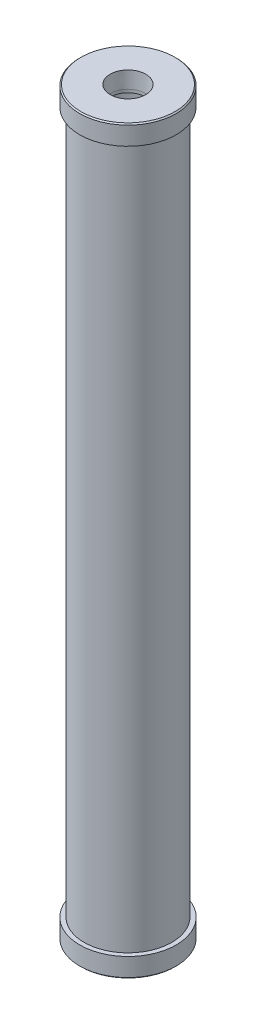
ISO-10303-21;
HEADER;
FILE_DESCRIPTION(('STEP AP214'),'2;1');
FILE_NAME('part.step','',(''),(''),'','','');
FILE_SCHEMA(('AUTOMOTIVE_DESIGN { 1 0 10303 214 1 1 1 1 }'));
ENDSEC;
DATA;
#1=APPLICATION_CONTEXT('core data for automotive mechanical design processes');
#2=APPLICATION_PROTOCOL_DEFINITION('international standard','automotive_design',2000,#1);
#3=PRODUCT_CONTEXT('',#1,'mechanical');
#4=PRODUCT('Part','Part','',(#3));
#5=PRODUCT_RELATED_PRODUCT_CATEGORY('part','',(#4));
#6=PRODUCT_DEFINITION_FORMATION('','',#4);
#7=PRODUCT_DEFINITION_CONTEXT('part definition',#1,'design');
#8=PRODUCT_DEFINITION('design','',#6,#7);
#9=PRODUCT_DEFINITION_SHAPE('','',#8);
#10=(LENGTH_UNIT() NAMED_UNIT(*) SI_UNIT(.MILLI.,.METRE.));
#11=(NAMED_UNIT(*) PLANE_ANGLE_UNIT() SI_UNIT($,.RADIAN.));
#12=(NAMED_UNIT(*) SI_UNIT($,.STERADIAN.) SOLID_ANGLE_UNIT());
#13=UNCERTAINTY_MEASURE_WITH_UNIT(LENGTH_MEASURE(1.E-05),#10,'distance_accuracy_value','');
#14=(GEOMETRIC_REPRESENTATION_CONTEXT(3) GLOBAL_UNCERTAINTY_ASSIGNED_CONTEXT((#13)) GLOBAL_UNIT_ASSIGNED_CONTEXT((#10,
#11,#12)) REPRESENTATION_CONTEXT('',''));
#15=CARTESIAN_POINT('',(0.,0.,0.));
#16=DIRECTION('',(0.,0.,1.));
#17=DIRECTION('',(1.,0.,0.));
#18=AXIS2_PLACEMENT_3D('',#15,#16,#17);
#19=CARTESIAN_POINT('',(0.,965.2,0.));
#20=DIRECTION('',(0.,-1.,0.));
#21=DIRECTION('',(0.,0.,-1.));
#22=AXIS2_PLACEMENT_3D('',#19,#20,#21);
#23=CYLINDRICAL_SURFACE('',#22,57.15);
#24=CARTESIAN_POINT('',(0.,25.4,0.));
#25=DIRECTION('',(0.,1.,0.));
#26=DIRECTION('',(0.,0.,1.));
#27=AXIS2_PLACEMENT_3D('',#24,#25,#26);
#28=CIRCLE('',#27,57.15);
#29=CARTESIAN_POINT('',(0.,25.3999999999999,-57.15));
#30=VERTEX_POINT('',#29);
#31=EDGE_CURVE('E71',#30,#30,#28,.T.);
#32=CARTESIAN_POINT('',(0.,939.8,0.));
#33=DIRECTION('',(0.,1.,0.));
#34=DIRECTION('',(0.,0.,1.));
#35=AXIS2_PLACEMENT_3D('',#32,#33,#34);
#36=CIRCLE('',#35,57.15);
#37=CARTESIAN_POINT('',(0.,939.8,-57.15));
#38=VERTEX_POINT('',#37);
#39=EDGE_CURVE('E53',#38,#38,#36,.T.);
#40=CARTESIAN_POINT('',(0.,25.3999999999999,-57.15));
#41=CARTESIAN_POINT('',(0.,34.9249999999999,-57.15));
#42=CARTESIAN_POINT('',(0.,44.4499999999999,-57.15));
#43=CARTESIAN_POINT('',(0.,63.4999999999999,-57.15));
#44=CARTESIAN_POINT('',(0.,73.0249999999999,-57.15));
#45=CARTESIAN_POINT('',(0.,92.0749999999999,-57.15));
#46=CARTESIAN_POINT('',(0.,101.6,-57.15));
#47=CARTESIAN_POINT('',(0.,120.65,-57.15));
#48=CARTESIAN_POINT('',(0.,130.175,-57.15));
#49=CARTESIAN_POINT('',(0.,149.225,-57.15));
#50=CARTESIAN_POINT('',(0.,158.75,-57.15));
#51=CARTESIAN_POINT('',(0.,177.8,-57.15));
#52=CARTESIAN_POINT('',(0.,187.325,-57.15));
#53=CARTESIAN_POINT('',(0.,206.375,-57.15));
#54=CARTESIAN_POINT('',(0.,215.9,-57.15));
#55=CARTESIAN_POINT('',(0.,234.95,-57.15));
#56=CARTESIAN_POINT('',(0.,244.475,-57.15));
#57=CARTESIAN_POINT('',(0.,263.525,-57.15));
#58=CARTESIAN_POINT('',(0.,273.05,-57.15));
#59=CARTESIAN_POINT('',(0.,292.1,-57.15));
#60=CARTESIAN_POINT('',(0.,301.625,-57.15));
#61=CARTESIAN_POINT('',(0.,320.675,-57.15));
#62=CARTESIAN_POINT('',(0.,330.2,-57.15));
#63=CARTESIAN_POINT('',(0.,349.25,-57.15));
#64=CARTESIAN_POINT('',(0.,358.775,-57.15));
#65=CARTESIAN_POINT('',(0.,377.825,-57.15));
#66=CARTESIAN_POINT('',(0.,387.35,-57.15));
#67=CARTESIAN_POINT('',(0.,406.4,-57.15));
#68=CARTESIAN_POINT('',(0.,415.925,-57.15));
#69=CARTESIAN_POINT('',(0.,434.975,-57.15));
#70=CARTESIAN_POINT('',(0.,444.5,-57.15));
#71=CARTESIAN_POINT('',(0.,463.55,-57.15));
#72=CARTESIAN_POINT('',(0.,473.075,-57.15));
#73=CARTESIAN_POINT('',(0.,492.125,-57.15));
#74=CARTESIAN_POINT('',(0.,501.65,-57.15));
#75=CARTESIAN_POINT('',(0.,520.7,-57.15));
#76=CARTESIAN_POINT('',(0.,530.225,-57.15));
#77=CARTESIAN_POINT('',(0.,549.275,-57.15));
#78=CARTESIAN_POINT('',(0.,558.8,-57.15));
#79=CARTESIAN_POINT('',(0.,577.85,-57.15));
#80=CARTESIAN_POINT('',(0.,587.375,-57.15));
#81=CARTESIAN_POINT('',(0.,606.425,-57.15));
#82=CARTESIAN_POINT('',(0.,615.95,-57.15));
#83=CARTESIAN_POINT('',(0.,635.,-57.15));
#84=CARTESIAN_POINT('',(0.,644.525,-57.15));
#85=CARTESIAN_POINT('',(0.,663.575,-57.15));
#86=CARTESIAN_POINT('',(0.,673.1,-57.15));
#87=CARTESIAN_POINT('',(0.,692.15,-57.15));
#88=CARTESIAN_POINT('',(0.,701.675,-57.15));
#89=CARTESIAN_POINT('',(0.,720.725,-57.15));
#90=CARTESIAN_POINT('',(0.,730.25,-57.15));
#91=CARTESIAN_POINT('',(0.,749.3,-57.15));
#92=CARTESIAN_POINT('',(0.,758.825,-57.15));
#93=CARTESIAN_POINT('',(0.,777.875,-57.15));
#94=CARTESIAN_POINT('',(0.,787.4,-57.15));
#95=CARTESIAN_POINT('',(0.,806.45,-57.15));
#96=CARTESIAN_POINT('',(0.,815.975,-57.15));
#97=CARTESIAN_POINT('',(0.,835.025,-57.15));
#98=CARTESIAN_POINT('',(0.,844.55,-57.15));
#99=CARTESIAN_POINT('',(0.,863.6,-57.15));
#100=CARTESIAN_POINT('',(0.,873.125,-57.15));
#101=CARTESIAN_POINT('',(0.,892.175,-57.15));
#102=CARTESIAN_POINT('',(0.,901.7,-57.15));
#103=CARTESIAN_POINT('',(0.,920.75,-57.15));
#104=CARTESIAN_POINT('',(0.,930.275,-57.15));
#105=CARTESIAN_POINT('',(0.,939.8,-57.15));
#106=B_SPLINE_CURVE_WITH_KNOTS('',3,(#40,#41,#42,#43,#44,#45,#46,#47,#48,#49,#50,#51,#52,#53,
#54,#55,#56,#57,#58,#59,#60,#61,#62,#63,#64,#65,#66,#67,#68,#69,#70,#71,#72,#73,#74,#75,#76,#77,
#78,#79,#80,#81,#82,#83,#84,#85,#86,#87,#88,#89,#90,#91,#92,#93,#94,#95,#96,#97,#98,#99,#100,
#101,#102,#103,#104,#105),.UNSPECIFIED.,.F.,.F.,(4,2,2,2,2,2,2,2,2,2,2,2,2,2,2,2,2,2,2,2,2,2,2,
2,2,2,2,2,2,2,2,2,4),(0.,28.575,57.15,85.7250000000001,114.3,142.875,171.45,200.025,228.6,
257.175,285.75,314.325,342.9,371.475,400.05,428.625,457.2,485.775,514.35,542.925,571.5,600.075,
628.65,657.225,685.8,714.375,742.95,771.525,800.1,828.675,857.25,885.825,914.4),.UNSPECIFIED.);
#107=EDGE_CURVE('BSEAM33',#30,#38,#106,.T.);
#108=ORIENTED_EDGE('',*,*,#31,.T.);
#109=ORIENTED_EDGE('',*,*,#39,.F.);
#110=ORIENTED_EDGE('',*,*,#107,.T.);
#111=ORIENTED_EDGE('',*,*,#107,.F.);
#112=EDGE_LOOP('',(#108,#110,#109,#111));
#113=FACE_BOUND('',#112,.T.);
#114=ADVANCED_FACE('F33',(#113),#23,.T.);
#115=CARTESIAN_POINT('',(0.,965.2,0.));
#116=DIRECTION('',(0.,-1.,0.));
#117=DIRECTION('',(0.,0.,-1.));
#118=AXIS2_PLACEMENT_3D('',#115,#116,#117);
#119=CYLINDRICAL_SURFACE('',#118,50.546);
#120=CARTESIAN_POINT('',(0.,25.4,0.));
#121=DIRECTION('',(0.,1.,0.));
#122=DIRECTION('',(0.,0.,1.));
#123=AXIS2_PLACEMENT_3D('',#120,#121,#122);
#124=CIRCLE('',#123,50.546);
#125=CARTESIAN_POINT('',(0.,25.3999999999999,-50.546));
#126=VERTEX_POINT('',#125);
#127=EDGE_CURVE('E68',#126,#126,#124,.T.);
#128=CARTESIAN_POINT('',(0.,939.8,0.));
#129=DIRECTION('',(0.,1.,0.));
#130=DIRECTION('',(0.,0.,1.));
#131=AXIS2_PLACEMENT_3D('',#128,#129,#130);
#132=CIRCLE('',#131,50.546);
#133=CARTESIAN_POINT('',(0.,939.8,-50.546));
#134=VERTEX_POINT('',#133);
#135=EDGE_CURVE('E59',#134,#134,#132,.T.);
#136=CARTESIAN_POINT('',(0.,25.3999999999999,-50.546));
#137=CARTESIAN_POINT('',(0.,34.9249999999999,-50.546));
#138=CARTESIAN_POINT('',(0.,44.4499999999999,-50.546));
#139=CARTESIAN_POINT('',(0.,63.4999999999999,-50.546));
#140=CARTESIAN_POINT('',(0.,73.0249999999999,-50.546));
#141=CARTESIAN_POINT('',(0.,92.0749999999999,-50.546));
#142=CARTESIAN_POINT('',(0.,101.6,-50.546));
#143=CARTESIAN_POINT('',(0.,120.65,-50.546));
#144=CARTESIAN_POINT('',(0.,130.175,-50.546));
#145=CARTESIAN_POINT('',(0.,149.225,-50.546));
#146=CARTESIAN_POINT('',(0.,158.75,-50.546));
#147=CARTESIAN_POINT('',(0.,177.8,-50.546));
#148=CARTESIAN_POINT('',(0.,187.325,-50.546));
#149=CARTESIAN_POINT('',(0.,206.375,-50.546));
#150=CARTESIAN_POINT('',(0.,215.9,-50.546));
#151=CARTESIAN_POINT('',(0.,234.95,-50.546));
#152=CARTESIAN_POINT('',(0.,244.475,-50.546));
#153=CARTESIAN_POINT('',(0.,263.525,-50.546));
#154=CARTESIAN_POINT('',(0.,273.05,-50.546));
#155=CARTESIAN_POINT('',(0.,292.1,-50.546));
#156=CARTESIAN_POINT('',(0.,301.625,-50.546));
#157=CARTESIAN_POINT('',(0.,320.675,-50.546));
#158=CARTESIAN_POINT('',(0.,330.2,-50.546));
#159=CARTESIAN_POINT('',(0.,349.25,-50.546));
#160=CARTESIAN_POINT('',(0.,358.775,-50.546));
#161=CARTESIAN_POINT('',(0.,377.825,-50.546));
#162=CARTESIAN_POINT('',(0.,387.35,-50.546));
#163=CARTESIAN_POINT('',(0.,406.4,-50.546));
#164=CARTESIAN_POINT('',(0.,415.925,-50.546));
#165=CARTESIAN_POINT('',(0.,434.975,-50.546));
#166=CARTESIAN_POINT('',(0.,444.5,-50.546));
#167=CARTESIAN_POINT('',(0.,463.55,-50.546));
#168=CARTESIAN_POINT('',(0.,473.075,-50.546));
#169=CARTESIAN_POINT('',(0.,492.125,-50.546));
#170=CARTESIAN_POINT('',(0.,501.65,-50.546));
#171=CARTESIAN_POINT('',(0.,520.7,-50.546));
#172=CARTESIAN_POINT('',(0.,530.225,-50.546));
#173=CARTESIAN_POINT('',(0.,549.275,-50.546));
#174=CARTESIAN_POINT('',(0.,558.8,-50.546));
#175=CARTESIAN_POINT('',(0.,577.85,-50.546));
#176=CARTESIAN_POINT('',(0.,587.375,-50.546));
#177=CARTESIAN_POINT('',(0.,606.425,-50.546));
#178=CARTESIAN_POINT('',(0.,615.95,-50.546));
#179=CARTESIAN_POINT('',(0.,635.,-50.546));
#180=CARTESIAN_POINT('',(0.,644.525,-50.546));
#181=CARTESIAN_POINT('',(0.,663.575,-50.546));
#182=CARTESIAN_POINT('',(0.,673.1,-50.546));
#183=CARTESIAN_POINT('',(0.,692.15,-50.546));
#184=CARTESIAN_POINT('',(0.,701.675,-50.546));
#185=CARTESIAN_POINT('',(0.,720.725,-50.546));
#186=CARTESIAN_POINT('',(0.,730.25,-50.546));
#187=CARTESIAN_POINT('',(0.,749.3,-50.546));
#188=CARTESIAN_POINT('',(0.,758.825,-50.546));
#189=CARTESIAN_POINT('',(0.,777.875,-50.546));
#190=CARTESIAN_POINT('',(0.,787.4,-50.546));
#191=CARTESIAN_POINT('',(0.,806.45,-50.546));
#192=CARTESIAN_POINT('',(0.,815.975,-50.546));
#193=CARTESIAN_POINT('',(0.,835.025,-50.546));
#194=CARTESIAN_POINT('',(0.,844.55,-50.546));
#195=CARTESIAN_POINT('',(0.,863.6,-50.546));
#196=CARTESIAN_POINT('',(0.,873.125,-50.546));
#197=CARTESIAN_POINT('',(0.,892.175,-50.546));
#198=CARTESIAN_POINT('',(0.,901.7,-50.546));
#199=CARTESIAN_POINT('',(0.,920.75,-50.546));
#200=CARTESIAN_POINT('',(0.,930.275,-50.546));
#201=CARTESIAN_POINT('',(0.,939.8,-50.546));
#202=B_SPLINE_CURVE_WITH_KNOTS('',3,(#136,#137,#138,#139,#140,#141,#142,#143,#144,#145,#146,
#147,#148,#149,#150,#151,#152,#153,#154,#155,#156,#157,#158,#159,#160,#161,#162,#163,#164,#165,
#166,#167,#168,#169,#170,#171,#172,#173,#174,#175,#176,#177,#178,#179,#180,#181,#182,#183,#184,
#185,#186,#187,#188,#189,#190,#191,#192,#193,#194,#195,#196,#197,#198,#199,#200,#201),
.UNSPECIFIED.,.F.,.F.,(4,2,2,2,2,2,2,2,2,2,2,2,2,2,2,2,2,2,2,2,2,2,2,2,2,2,2,2,2,2,2,2,4),(0.,
28.575,57.15,85.7250000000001,114.3,142.875,171.45,200.025,228.6,257.175,285.75,314.325,342.9,
371.475,400.05,428.625,457.2,485.775,514.35,542.925,571.5,600.075,628.65,657.225,685.8,714.375,
742.95,771.525,800.1,828.675,857.25,885.825,914.4),.UNSPECIFIED.);
#203=EDGE_CURVE('BSEAM115',#126,#134,#202,.T.);
#204=ORIENTED_EDGE('',*,*,#127,.F.);
#205=ORIENTED_EDGE('',*,*,#135,.T.);
#206=ORIENTED_EDGE('',*,*,#203,.T.);
#207=ORIENTED_EDGE('',*,*,#203,.F.);
#208=EDGE_LOOP('',(#204,#206,#205,#207));
#209=FACE_BOUND('',#208,.T.);
#210=ADVANCED_FACE('F115',(#209),#119,.F.);
#211=CARTESIAN_POINT('',(0.,25.4,0.));
#212=DIRECTION('',(0.,1.,0.));
#213=DIRECTION('',(0.,0.,1.));
#214=AXIS2_PLACEMENT_3D('',#211,#212,#213);
#215=PLANE('',#214);
#216=CARTESIAN_POINT('',(0.,25.4,0.));
#217=DIRECTION('',(0.,1.,0.));
#218=DIRECTION('',(0.,0.,1.));
#219=AXIS2_PLACEMENT_3D('',#216,#217,#218);
#220=CIRCLE('',#219,22.6);
#221=CARTESIAN_POINT('',(0.,25.4,22.6));
#222=VERTEX_POINT('',#221);
#223=EDGE_CURVE('E63',#222,#222,#220,.T.);
#224=ORIENTED_EDGE('',*,*,#223,.F.);
#225=EDGE_LOOP('',(#224));
#226=FACE_BOUND('',#225,.T.);
#227=ORIENTED_EDGE('',*,*,#127,.T.);
#228=EDGE_LOOP('',(#227));
#229=FACE_BOUND('',#228,.T.);
#230=ADVANCED_FACE('F121',(#226,#229),#215,.T.);
#231=CARTESIAN_POINT('',(0.,25.4,0.));
#232=DIRECTION('',(0.,1.,0.));
#233=DIRECTION('',(0.,0.,1.));
#234=AXIS2_PLACEMENT_3D('',#231,#232,#233);
#235=CIRCLE('',#234,62.865);
#236=CARTESIAN_POINT('',(0.,25.4,62.865));
#237=VERTEX_POINT('',#236);
#238=EDGE_CURVE('E66',#237,#237,#235,.T.);
#239=ORIENTED_EDGE('',*,*,#238,.T.);
#240=EDGE_LOOP('',(#239));
#241=FACE_BOUND('',#240,.T.);
#242=ORIENTED_EDGE('',*,*,#31,.F.);
#243=EDGE_LOOP('',(#242));
#244=FACE_BOUND('',#243,.T.);
#245=ADVANCED_FACE('F142',(#241,#244),#215,.T.);
#246=CARTESIAN_POINT('',(0.,25.4,0.));
#247=DIRECTION('',(0.,-1.,0.));
#248=DIRECTION('',(0.,0.,-1.));
#249=AXIS2_PLACEMENT_3D('',#246,#247,#248);
#250=CYLINDRICAL_SURFACE('',#249,62.865);
#251=CARTESIAN_POINT('',(0.,1.52400000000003,0.));
#252=DIRECTION('',(0.,1.,0.));
#253=DIRECTION('',(0.,0.,1.));
#254=AXIS2_PLACEMENT_3D('',#251,#252,#253);
#255=CIRCLE('',#254,62.865);
#256=CARTESIAN_POINT('',(0.,1.52400000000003,62.865));
#257=VERTEX_POINT('',#256);
#258=EDGE_CURVE('E48',#257,#257,#255,.T.);
#259=ORIENTED_EDGE('',*,*,#258,.T.);
#260=EDGE_LOOP('',(#259));
#261=FACE_BOUND('',#260,.T.);
#262=ORIENTED_EDGE('',*,*,#238,.F.);
#263=EDGE_LOOP('',(#262));
#264=FACE_BOUND('',#263,.T.);
#265=ADVANCED_FACE('F139',(#261,#264),#250,.T.);
#266=CARTESIAN_POINT('',(0.,0.,0.));
#267=DIRECTION('',(0.,1.,0.));
#268=DIRECTION('',(0.,0.,1.));
#269=AXIS2_PLACEMENT_3D('',#266,#267,#268);
#270=PLANE('',#269);
#271=CARTESIAN_POINT('',(0.,0.,0.));
#272=DIRECTION('',(0.,1.,0.));
#273=DIRECTION('',(0.,0.,1.));
#274=AXIS2_PLACEMENT_3D('',#271,#272,#273);
#275=CIRCLE('',#274,61.341);
#276=CARTESIAN_POINT('',(0.,0.,61.341));
#277=VERTEX_POINT('',#276);
#278=EDGE_CURVE('E44',#277,#277,#275,.F.);
#279=ORIENTED_EDGE('',*,*,#278,.T.);
#280=EDGE_LOOP('',(#279));
#281=FACE_BOUND('',#280,.T.);
#282=CARTESIAN_POINT('',(0.,0.,0.));
#283=DIRECTION('',(0.,-1.,0.));
#284=DIRECTION('',(0.,0.,-1.));
#285=AXIS2_PLACEMENT_3D('',#282,#283,#284);
#286=CIRCLE('',#285,23.160002);
#287=CARTESIAN_POINT('',(0.,0.,-23.160002));
#288=VERTEX_POINT('',#287);
#289=EDGE_CURVE('E62',#288,#288,#286,.T.);
#290=ORIENTED_EDGE('',*,*,#289,.F.);
#291=EDGE_LOOP('',(#290));
#292=FACE_BOUND('',#291,.T.);
#293=ADVANCED_FACE('F124',(#281,#292),#270,.F.);
#294=CARTESIAN_POINT('',(0.,0.,0.));
#295=DIRECTION('',(0.,-1.,0.));
#296=DIRECTION('',(0.,0.,-1.));
#297=AXIS2_PLACEMENT_3D('',#294,#295,#296);
#298=CYLINDRICAL_SURFACE('',#297,22.6);
#299=ORIENTED_EDGE('',*,*,#223,.T.);
#300=EDGE_LOOP('',(#299));
#301=FACE_BOUND('',#300,.T.);
#302=CARTESIAN_POINT('',(0.,21.336,0.));
#303=DIRECTION('',(0.,-1.,0.));
#304=DIRECTION('',(0.,0.,-1.));
#305=AXIS2_PLACEMENT_3D('',#302,#303,#304);
#306=CIRCLE('',#305,22.6);
#307=CARTESIAN_POINT('',(0.,21.336,-22.6));
#308=VERTEX_POINT('',#307);
#309=EDGE_CURVE('E67',#308,#308,#306,.T.);
#310=ORIENTED_EDGE('',*,*,#309,.T.);
#311=EDGE_LOOP('',(#310));
#312=FACE_BOUND('',#311,.T.);
#313=ADVANCED_FACE('F155',(#301,#312),#298,.F.);
#314=CARTESIAN_POINT('',(22.6,21.336,0.));
#315=DIRECTION('',(0.,-1.,0.));
#316=DIRECTION('',(0.,0.,-1.));
#317=AXIS2_PLACEMENT_3D('',#314,#315,#316);
#318=PLANE('',#317);
#319=ORIENTED_EDGE('',*,*,#309,.F.);
#320=EDGE_LOOP('',(#319));
#321=FACE_BOUND('',#320,.T.);
#322=CARTESIAN_POINT('',(0.,21.336,0.));
#323=DIRECTION('',(0.,-1.,0.));
#324=DIRECTION('',(0.,0.,-1.));
#325=AXIS2_PLACEMENT_3D('',#322,#323,#324);
#326=CIRCLE('',#325,22.4939641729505);
#327=CARTESIAN_POINT('',(0.,21.336,-22.4939641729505));
#328=VERTEX_POINT('',#327);
#329=EDGE_CURVE('E78',#328,#328,#326,.T.);
#330=ORIENTED_EDGE('',*,*,#329,.T.);
#331=EDGE_LOOP('',(#330));
#332=FACE_BOUND('',#331,.T.);
#333=ADVANCED_FACE('F158',(#321,#332),#318,.F.);
#334=CARTESIAN_POINT('',(0.,0.,0.));
#335=DIRECTION('',(0.,-1.,0.));
#336=DIRECTION('',(0.,0.,-1.));
#337=AXIS2_PLACEMENT_3D('',#334,#335,#336);
#338=CONICAL_SURFACE('',#337,23.160002,0.0312064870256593);
#339=ORIENTED_EDGE('',*,*,#329,.F.);
#340=EDGE_LOOP('',(#339));
#341=FACE_BOUND('',#340,.T.);
#342=ORIENTED_EDGE('',*,*,#289,.T.);
#343=EDGE_LOOP('',(#342));
#344=FACE_BOUND('',#343,.T.);
#345=ADVANCED_FACE('F162',(#341,#344),#338,.F.);
#346=CARTESIAN_POINT('',(0.,939.8,0.));
#347=DIRECTION('',(0.,1.,0.));
#348=DIRECTION('',(0.,0.,1.));
#349=AXIS2_PLACEMENT_3D('',#346,#347,#348);
#350=PLANE('',#349);
#351=CARTESIAN_POINT('',(0.,939.8,0.));
#352=DIRECTION('',(0.,1.,0.));
#353=DIRECTION('',(0.,0.,1.));
#354=AXIS2_PLACEMENT_3D('',#351,#352,#353);
#355=CIRCLE('',#354,22.6);
#356=CARTESIAN_POINT('',(0.,939.8,22.6));
#357=VERTEX_POINT('',#356);
#358=EDGE_CURVE('E54',#357,#357,#355,.T.);
#359=ORIENTED_EDGE('',*,*,#358,.T.);
#360=EDGE_LOOP('',(#359));
#361=FACE_BOUND('',#360,.T.);
#362=ORIENTED_EDGE('',*,*,#135,.F.);
#363=EDGE_LOOP('',(#362));
#364=FACE_BOUND('',#363,.T.);
#365=ADVANCED_FACE('F165',(#361,#364),#350,.F.);
#366=CARTESIAN_POINT('',(0.,939.8,0.));
#367=DIRECTION('',(0.,1.,0.));
#368=DIRECTION('',(0.,0.,1.));
#369=AXIS2_PLACEMENT_3D('',#366,#367,#368);
#370=CIRCLE('',#369,62.865);
#371=CARTESIAN_POINT('',(0.,939.8,62.865));
#372=VERTEX_POINT('',#371);
#373=EDGE_CURVE('E57',#372,#372,#370,.T.);
#374=ORIENTED_EDGE('',*,*,#373,.F.);
#375=EDGE_LOOP('',(#374));
#376=FACE_BOUND('',#375,.T.);
#377=ORIENTED_EDGE('',*,*,#39,.T.);
#378=EDGE_LOOP('',(#377));
#379=FACE_BOUND('',#378,.T.);
#380=ADVANCED_FACE('F110',(#376,#379),#350,.F.);
#381=CARTESIAN_POINT('',(0.,939.8,0.));
#382=DIRECTION('',(0.,1.,0.));
#383=DIRECTION('',(0.,0.,1.));
#384=AXIS2_PLACEMENT_3D('',#381,#382,#383);
#385=CYLINDRICAL_SURFACE('',#384,62.865);
#386=CARTESIAN_POINT('',(0.,963.676,0.));
#387=DIRECTION('',(0.,1.,0.));
#388=DIRECTION('',(0.,0.,1.));
#389=AXIS2_PLACEMENT_3D('',#386,#387,#388);
#390=CIRCLE('',#389,62.865);
#391=CARTESIAN_POINT('',(0.,963.676,62.865));
#392=VERTEX_POINT('',#391);
#393=EDGE_CURVE('E10',#392,#392,#390,.F.);
#394=ORIENTED_EDGE('',*,*,#393,.T.);
#395=EDGE_LOOP('',(#394));
#396=FACE_BOUND('',#395,.T.);
#397=ORIENTED_EDGE('',*,*,#373,.T.);
#398=EDGE_LOOP('',(#397));
#399=FACE_BOUND('',#398,.T.);
#400=ADVANCED_FACE('F101',(#396,#399),#385,.T.);
#401=CARTESIAN_POINT('',(0.,965.2,0.));
#402=DIRECTION('',(0.,1.,0.));
#403=DIRECTION('',(0.,0.,1.));
#404=AXIS2_PLACEMENT_3D('',#401,#402,#403);
#405=PLANE('',#404);
#406=CARTESIAN_POINT('',(0.,965.2,0.));
#407=DIRECTION('',(0.,1.,0.));
#408=DIRECTION('',(0.,0.,1.));
#409=AXIS2_PLACEMENT_3D('',#406,#407,#408);
#410=CIRCLE('',#409,61.3410000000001);
#411=CARTESIAN_POINT('',(0.,965.2,61.3410000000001));
#412=VERTEX_POINT('',#411);
#413=EDGE_CURVE('E40',#412,#412,#410,.T.);
#414=ORIENTED_EDGE('',*,*,#413,.T.);
#415=EDGE_LOOP('',(#414));
#416=FACE_BOUND('',#415,.T.);
#417=CARTESIAN_POINT('',(0.,965.2,0.));
#418=DIRECTION('',(0.,1.,0.));
#419=DIRECTION('',(0.,0.,1.));
#420=AXIS2_PLACEMENT_3D('',#417,#418,#419);
#421=CIRCLE('',#420,23.160002);
#422=CARTESIAN_POINT('',(0.,965.2,23.160002));
#423=VERTEX_POINT('',#422);
#424=EDGE_CURVE('E92',#423,#423,#421,.T.);
#425=ORIENTED_EDGE('',*,*,#424,.F.);
#426=EDGE_LOOP('',(#425));
#427=FACE_BOUND('',#426,.T.);
#428=ADVANCED_FACE('F98',(#416,#427),#405,.T.);
#429=CARTESIAN_POINT('',(0.,965.2,0.));
#430=DIRECTION('',(0.,1.,0.));
#431=DIRECTION('',(0.,0.,1.));
#432=AXIS2_PLACEMENT_3D('',#429,#430,#431);
#433=CYLINDRICAL_SURFACE('',#432,22.6);
#434=CARTESIAN_POINT('',(0.,943.864,0.));
#435=DIRECTION('',(0.,1.,0.));
#436=DIRECTION('',(0.,0.,1.));
#437=AXIS2_PLACEMENT_3D('',#434,#435,#436);
#438=CIRCLE('',#437,22.6);
#439=CARTESIAN_POINT('',(0.,943.864,22.6));
#440=VERTEX_POINT('',#439);
#441=EDGE_CURVE('E58',#440,#440,#438,.T.);
#442=ORIENTED_EDGE('',*,*,#441,.T.);
#443=EDGE_LOOP('',(#442));
#444=FACE_BOUND('',#443,.T.);
#445=ORIENTED_EDGE('',*,*,#358,.F.);
#446=EDGE_LOOP('',(#445));
#447=FACE_BOUND('',#446,.T.);
#448=ADVANCED_FACE('F100',(#444,#447),#433,.F.);
#449=CARTESIAN_POINT('',(22.6,943.864,0.));
#450=DIRECTION('',(0.,1.,0.));
#451=DIRECTION('',(0.,0.,1.));
#452=AXIS2_PLACEMENT_3D('',#449,#450,#451);
#453=PLANE('',#452);
#454=ORIENTED_EDGE('',*,*,#441,.F.);
#455=EDGE_LOOP('',(#454));
#456=FACE_BOUND('',#455,.T.);
#457=CARTESIAN_POINT('',(0.,943.864,0.));
#458=DIRECTION('',(0.,1.,0.));
#459=DIRECTION('',(0.,0.,1.));
#460=AXIS2_PLACEMENT_3D('',#457,#458,#459);
#461=CIRCLE('',#460,22.4939641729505);
#462=CARTESIAN_POINT('',(0.,943.864,22.4939641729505));
#463=VERTEX_POINT('',#462);
#464=EDGE_CURVE('E89',#463,#463,#461,.T.);
#465=ORIENTED_EDGE('',*,*,#464,.T.);
#466=EDGE_LOOP('',(#465));
#467=FACE_BOUND('',#466,.T.);
#468=ADVANCED_FACE('F107',(#456,#467),#453,.F.);
#469=CARTESIAN_POINT('',(0.,965.2,0.));
#470=DIRECTION('',(0.,1.,0.));
#471=DIRECTION('',(0.,0.,1.));
#472=AXIS2_PLACEMENT_3D('',#469,#470,#471);
#473=CONICAL_SURFACE('',#472,23.160002,0.0312064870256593);
#474=ORIENTED_EDGE('',*,*,#464,.F.);
#475=EDGE_LOOP('',(#474));
#476=FACE_BOUND('',#475,.T.);
#477=ORIENTED_EDGE('',*,*,#424,.T.);
#478=EDGE_LOOP('',(#477));
#479=FACE_BOUND('',#478,.T.);
#480=ADVANCED_FACE('F96',(#476,#479),#473,.F.);
#481=CARTESIAN_POINT('',(0.,1.52400000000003,0.));
#482=DIRECTION('',(0.,1.,0.));
#483=DIRECTION('',(0.,0.,1.));
#484=AXIS2_PLACEMENT_3D('',#481,#482,#483);
#485=CONICAL_SURFACE('',#484,62.865,0.785398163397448);
#486=CARTESIAN_POINT('',(0.,0.,61.341));
#487=CARTESIAN_POINT('',(0.,0.0158749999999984,61.356875));
#488=CARTESIAN_POINT('',(0.,0.0317499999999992,61.37275));
#489=CARTESIAN_POINT('',(0.,0.0635000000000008,61.4045));
#490=CARTESIAN_POINT('',(0.,0.0793750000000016,61.420375));
#491=CARTESIAN_POINT('',(0.,0.111125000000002,61.452125));
#492=CARTESIAN_POINT('',(0.,0.127000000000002,61.468));
#493=CARTESIAN_POINT('',(0.,0.158750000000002,61.49975));
#494=CARTESIAN_POINT('',(0.,0.174625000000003,61.515625));
#495=CARTESIAN_POINT('',(0.,0.206375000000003,61.547375));
#496=CARTESIAN_POINT('',(0.,0.222250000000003,61.56325));
#497=CARTESIAN_POINT('',(0.,0.254000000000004,61.595));
#498=CARTESIAN_POINT('',(0.,0.269875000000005,61.610875));
#499=CARTESIAN_POINT('',(0.,0.301625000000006,61.642625));
#500=CARTESIAN_POINT('',(0.,0.317500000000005,61.6585));
#501=CARTESIAN_POINT('',(0.,0.349250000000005,61.69025));
#502=CARTESIAN_POINT('',(0.,0.365125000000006,61.706125));
#503=CARTESIAN_POINT('',(0.,0.396875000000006,61.737875));
#504=CARTESIAN_POINT('',(0.,0.412750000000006,61.75375));
#505=CARTESIAN_POINT('',(0.,0.444500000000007,61.7855));
#506=CARTESIAN_POINT('',(0.,0.460375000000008,61.801375));
#507=CARTESIAN_POINT('',(0.,0.492125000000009,61.833125));
#508=CARTESIAN_POINT('',(0.,0.508000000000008,61.849));
#509=CARTESIAN_POINT('',(0.,0.539750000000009,61.88075));
#510=CARTESIAN_POINT('',(0.,0.555625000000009,61.896625));
#511=CARTESIAN_POINT('',(0.,0.587375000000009,61.928375));
#512=CARTESIAN_POINT('',(0.,0.603250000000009,61.94425));
#513=CARTESIAN_POINT('',(0.,0.63500000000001,61.976));
#514=CARTESIAN_POINT('',(0.,0.650875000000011,61.991875));
#515=CARTESIAN_POINT('',(0.,0.682625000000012,62.023625));
#516=CARTESIAN_POINT('',(0.,0.698500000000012,62.0395));
#517=CARTESIAN_POINT('',(0.,0.730250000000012,62.07125));
#518=CARTESIAN_POINT('',(0.,0.746125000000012,62.087125));
#519=CARTESIAN_POINT('',(0.,0.777875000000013,62.118875));
#520=CARTESIAN_POINT('',(0.,0.793750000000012,62.13475));
#521=CARTESIAN_POINT('',(0.,0.825500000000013,62.1665));
#522=CARTESIAN_POINT('',(0.,0.841375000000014,62.182375));
#523=CARTESIAN_POINT('',(0.,0.873125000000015,62.214125));
#524=CARTESIAN_POINT('',(0.,0.889000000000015,62.23));
#525=CARTESIAN_POINT('',(0.,0.920750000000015,62.26175));
#526=CARTESIAN_POINT('',(0.,0.936625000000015,62.277625));
#527=CARTESIAN_POINT('',(0.,0.968375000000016,62.309375));
#528=CARTESIAN_POINT('',(0.,0.984250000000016,62.32525));
#529=CARTESIAN_POINT('',(0.,1.01600000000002,62.357));
#530=CARTESIAN_POINT('',(0.,1.03187500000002,62.372875));
#531=CARTESIAN_POINT('',(0.,1.06362500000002,62.404625));
#532=CARTESIAN_POINT('',(0.,1.07950000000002,62.4205));
#533=CARTESIAN_POINT('',(0.,1.11125000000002,62.45225));
#534=CARTESIAN_POINT('',(0.,1.12712500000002,62.468125));
#535=CARTESIAN_POINT('',(0.,1.15887500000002,62.499875));
#536=CARTESIAN_POINT('',(0.,1.17475000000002,62.51575));
#537=CARTESIAN_POINT('',(0.,1.20650000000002,62.5475));
#538=CARTESIAN_POINT('',(0.,1.22237500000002,62.563375));
#539=CARTESIAN_POINT('',(0.,1.25412500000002,62.595125));
#540=CARTESIAN_POINT('',(0.,1.27000000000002,62.611));
#541=CARTESIAN_POINT('',(0.,1.30175000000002,62.64275));
#542=CARTESIAN_POINT('',(0.,1.31762500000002,62.658625));
#543=CARTESIAN_POINT('',(0.,1.34937500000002,62.690375));
#544=CARTESIAN_POINT('',(0.,1.36525000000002,62.70625));
#545=CARTESIAN_POINT('',(0.,1.39700000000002,62.738));
#546=CARTESIAN_POINT('',(0.,1.41287500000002,62.753875));
#547=CARTESIAN_POINT('',(0.,1.44462500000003,62.785625));
#548=CARTESIAN_POINT('',(0.,1.46050000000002,62.8015));
#549=CARTESIAN_POINT('',(0.,1.49225000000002,62.83325));
#550=CARTESIAN_POINT('',(0.,1.50812500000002,62.849125));
#551=CARTESIAN_POINT('',(0.,1.52400000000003,62.865));
#552=B_SPLINE_CURVE_WITH_KNOTS('',3,(#486,#487,#488,#489,#490,#491,#492,#493,#494,#495,#496,
#497,#498,#499,#500,#501,#502,#503,#504,#505,#506,#507,#508,#509,#510,#511,#512,#513,#514,#515,
#516,#517,#518,#519,#520,#521,#522,#523,#524,#525,#526,#527,#528,#529,#530,#531,#532,#533,#534,
#535,#536,#537,#538,#539,#540,#541,#542,#543,#544,#545,#546,#547,#548,#549,#550,#551),
.UNSPECIFIED.,.F.,.F.,(4,2,2,2,2,2,2,2,2,2,2,2,2,2,2,2,2,2,2,2,2,2,2,2,2,2,2,2,2,2,2,2,4),(0.,
0.067351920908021,0.134703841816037,0.202055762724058,0.269407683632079,0.3367596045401,
0.404111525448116,0.471463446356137,0.538815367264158,0.606167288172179,0.673519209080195,
0.740871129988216,0.808223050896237,0.875574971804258,0.942926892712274,1.0102788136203,
1.07763073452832,1.14498265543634,1.21233457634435,1.27968649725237,1.3470384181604,
1.41439033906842,1.48174225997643,1.54909418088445,1.61644610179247,1.68379802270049,
1.75114994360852,1.81850186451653,1.88585378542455,1.95320570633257,2.02055762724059,
2.08790954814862,2.15526146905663),.UNSPECIFIED.);
#553=EDGE_CURVE('BSEAM125',#277,#257,#552,.T.);
#554=ORIENTED_EDGE('',*,*,#278,.F.);
#555=ORIENTED_EDGE('',*,*,#258,.F.);
#556=ORIENTED_EDGE('',*,*,#553,.T.);
#557=ORIENTED_EDGE('',*,*,#553,.F.);
#558=EDGE_LOOP('',(#554,#556,#555,#557));
#559=FACE_BOUND('',#558,.T.);
#560=ADVANCED_FACE('F125',(#559),#485,.T.);
#561=CARTESIAN_POINT('',(0.,965.2,0.));
#562=DIRECTION('',(0.,-1.,0.));
#563=DIRECTION('',(0.,0.,-1.));
#564=AXIS2_PLACEMENT_3D('',#561,#562,#563);
#565=CONICAL_SURFACE('',#564,61.3410000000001,0.785398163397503);
#566=ORIENTED_EDGE('',*,*,#393,.F.);
#567=EDGE_LOOP('',(#566));
#568=FACE_BOUND('',#567,.T.);
#569=ORIENTED_EDGE('',*,*,#413,.F.);
#570=EDGE_LOOP('',(#569));
#571=FACE_BOUND('',#570,.T.);
#572=ADVANCED_FACE('F35',(#568,#571),#565,.T.);
#573=CLOSED_SHELL('',(#114,#210,#230,#245,#265,#293,#313,#333,#345,#365,#380,#400,#428,#448,
#468,#480,#560,#572));
#574=MANIFOLD_SOLID_BREP('B2',#573);
#575=ADVANCED_BREP_SHAPE_REPRESENTATION('',(#18,#574),#14);
#576=SHAPE_DEFINITION_REPRESENTATION(#9,#575);
ENDSEC;
END-ISO-10303-21;
